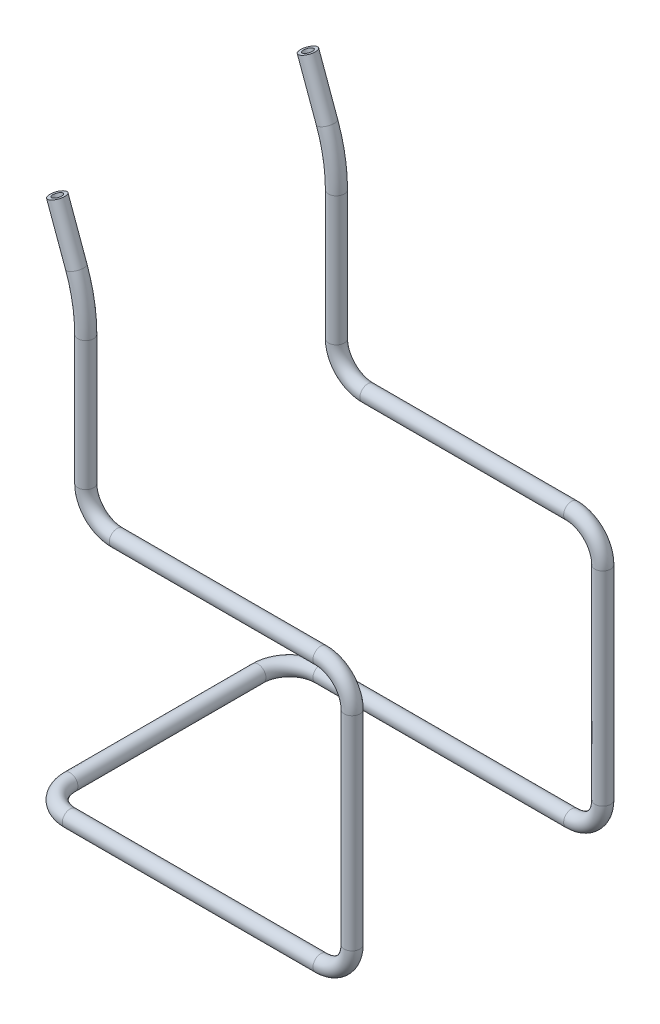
ISO-10303-21;
HEADER;
FILE_DESCRIPTION(('STEP AP214'),'2;1');
FILE_NAME('part.step','',(''),(''),'','','');
FILE_SCHEMA(('AUTOMOTIVE_DESIGN { 1 0 10303 214 1 1 1 1 }'));
ENDSEC;
DATA;
#1=APPLICATION_CONTEXT('core data for automotive mechanical design processes');
#2=APPLICATION_PROTOCOL_DEFINITION('international standard','automotive_design',2000,#1);
#3=PRODUCT_CONTEXT('',#1,'mechanical');
#4=PRODUCT('Part','Part','',(#3));
#5=PRODUCT_RELATED_PRODUCT_CATEGORY('part','',(#4));
#6=PRODUCT_DEFINITION_FORMATION('','',#4);
#7=PRODUCT_DEFINITION_CONTEXT('part definition',#1,'design');
#8=PRODUCT_DEFINITION('design','',#6,#7);
#9=PRODUCT_DEFINITION_SHAPE('','',#8);
#10=(LENGTH_UNIT() NAMED_UNIT(*) SI_UNIT(.MILLI.,.METRE.));
#11=(NAMED_UNIT(*) PLANE_ANGLE_UNIT() SI_UNIT($,.RADIAN.));
#12=(NAMED_UNIT(*) SI_UNIT($,.STERADIAN.) SOLID_ANGLE_UNIT());
#13=UNCERTAINTY_MEASURE_WITH_UNIT(LENGTH_MEASURE(1.E-05),#10,'distance_accuracy_value','');
#14=(GEOMETRIC_REPRESENTATION_CONTEXT(3) GLOBAL_UNCERTAINTY_ASSIGNED_CONTEXT((#13)) GLOBAL_UNIT_ASSIGNED_CONTEXT((#10,
#11,#12)) REPRESENTATION_CONTEXT('',''));
#15=CARTESIAN_POINT('',(0.,0.,0.));
#16=DIRECTION('',(0.,0.,1.));
#17=DIRECTION('',(1.,0.,0.));
#18=AXIS2_PLACEMENT_3D('',#15,#16,#17);
#19=CARTESIAN_POINT('',(11.9846310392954,153.28465813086,40.));
#20=DIRECTION('',(-0.34202014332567,0.939692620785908,0.));
#21=DIRECTION('',(-0.939692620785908,-0.34202014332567,0.));
#22=AXIS2_PLACEMENT_3D('',#19,#20,#21);
#23=CYLINDRICAL_SURFACE('',#22,2.5);
#24=CARTESIAN_POINT('',(11.9846310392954,153.28465813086,40.));
#25=DIRECTION('',(-0.34202014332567,0.939692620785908,0.));
#26=DIRECTION('',(0.,0.,-1.));
#27=AXIS2_PLACEMENT_3D('',#24,#25,#26);
#28=CIRCLE('',#27,2.5);
#29=CARTESIAN_POINT('',(14.3338625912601,154.139708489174,39.9999999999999));
#30=VERTEX_POINT('',#29);
#31=EDGE_CURVE('E30',#30,#30,#28,.T.);
#32=ORIENTED_EDGE('',*,*,#31,.T.);
#33=EDGE_LOOP('',(#32));
#34=FACE_BOUND('',#33,.T.);
#35=CARTESIAN_POINT('',(5.90074414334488,170.,40.0000000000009));
#36=DIRECTION('',(-0.34202014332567,0.939692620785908,0.));
#37=DIRECTION('',(0.,0.,-1.));
#38=AXIS2_PLACEMENT_3D('',#35,#36,#37);
#39=CIRCLE('',#38,2.5);
#40=CARTESIAN_POINT('',(5.90074414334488,170.,37.5000000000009));
#41=VERTEX_POINT('',#40);
#42=EDGE_CURVE('E10',#41,#41,#39,.T.);
#43=ORIENTED_EDGE('',*,*,#42,.F.);
#44=EDGE_LOOP('',(#43));
#45=FACE_BOUND('',#44,.T.);
#46=ADVANCED_FACE('F24',(#34,#45),#23,.T.);
#47=CARTESIAN_POINT('',(-35.,136.183650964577,40.0000000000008));
#48=DIRECTION('',(0.,0.,1.));
#49=DIRECTION('',(1.,0.,0.));
#50=AXIS2_PLACEMENT_3D('',#47,#48,#49);
#51=TOROIDAL_SURFACE('',#50,50.,2.5);
#52=CARTESIAN_POINT('',(15.,136.183650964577,39.9999999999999));
#53=DIRECTION('',(0.,1.,0.));
#54=DIRECTION('',(0.,0.,-1.));
#55=AXIS2_PLACEMENT_3D('',#52,#53,#54);
#56=CIRCLE('',#55,2.5);
#57=CARTESIAN_POINT('',(17.5,136.183650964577,39.9999999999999));
#58=VERTEX_POINT('',#57);
#59=EDGE_CURVE('E34',#58,#58,#56,.T.);
#60=CARTESIAN_POINT('',(-35.,136.183650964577,40.0000000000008));
#61=DIRECTION('',(0.,0.,1.));
#62=DIRECTION('',(1.,0.,0.));
#63=AXIS2_PLACEMENT_3D('',#60,#61,#62);
#64=CIRCLE('',#63,52.5);
#65=EDGE_CURVE('',#58,#30,#64,.T.);
#66=ORIENTED_EDGE('',*,*,#59,.T.);
#67=ORIENTED_EDGE('',*,*,#31,.F.);
#68=ORIENTED_EDGE('',*,*,#65,.T.);
#69=ORIENTED_EDGE('',*,*,#65,.F.);
#70=EDGE_LOOP('',(#66,#68,#67,#69));
#71=FACE_BOUND('',#70,.T.);
#72=ADVANCED_FACE('F182',(#71),#51,.T.);
#73=CARTESIAN_POINT('',(15.,95.,40.));
#74=DIRECTION('',(0.,1.,0.));
#75=DIRECTION('',(0.,0.,1.));
#76=AXIS2_PLACEMENT_3D('',#73,#74,#75);
#77=CYLINDRICAL_SURFACE('',#76,2.5);
#78=CARTESIAN_POINT('',(15.,95.,40.));
#79=DIRECTION('',(0.,1.,0.));
#80=DIRECTION('',(0.,0.,-1.));
#81=AXIS2_PLACEMENT_3D('',#78,#79,#80);
#82=CIRCLE('',#81,2.5);
#83=CARTESIAN_POINT('',(12.5,95.,40.));
#84=VERTEX_POINT('',#83);
#85=EDGE_CURVE('E38',#84,#84,#82,.T.);
#86=ORIENTED_EDGE('',*,*,#85,.T.);
#87=EDGE_LOOP('',(#86));
#88=FACE_BOUND('',#87,.T.);
#89=ORIENTED_EDGE('',*,*,#59,.F.);
#90=EDGE_LOOP('',(#89));
#91=FACE_BOUND('',#90,.T.);
#92=ADVANCED_FACE('F186',(#88,#91),#77,.T.);
#93=CARTESIAN_POINT('',(25.,95.,40.));
#94=DIRECTION('',(0.,0.,-1.));
#95=DIRECTION('',(-1.,0.,0.));
#96=AXIS2_PLACEMENT_3D('',#93,#94,#95);
#97=TOROIDAL_SURFACE('',#96,10.,2.5);
#98=CARTESIAN_POINT('',(25.,85.,40.));
#99=DIRECTION('',(-1.,0.,0.));
#100=DIRECTION('',(0.,0.,-1.));
#101=AXIS2_PLACEMENT_3D('',#98,#99,#100);
#102=CIRCLE('',#101,2.5);
#103=CARTESIAN_POINT('',(25.,82.5,40.));
#104=VERTEX_POINT('',#103);
#105=EDGE_CURVE('E43',#104,#104,#102,.T.);
#106=CARTESIAN_POINT('',(25.,95.,40.));
#107=DIRECTION('',(0.,0.,-1.));
#108=DIRECTION('',(-1.,0.,0.));
#109=AXIS2_PLACEMENT_3D('',#106,#107,#108);
#110=CIRCLE('',#109,12.5);
#111=EDGE_CURVE('',#104,#84,#110,.T.);
#112=ORIENTED_EDGE('',*,*,#105,.T.);
#113=ORIENTED_EDGE('',*,*,#85,.F.);
#114=ORIENTED_EDGE('',*,*,#111,.T.);
#115=ORIENTED_EDGE('',*,*,#111,.F.);
#116=EDGE_LOOP('',(#112,#114,#113,#115));
#117=FACE_BOUND('',#116,.T.);
#118=ADVANCED_FACE('F192',(#117),#97,.T.);
#119=CARTESIAN_POINT('',(90.,85.,40.));
#120=DIRECTION('',(-1.,0.,0.));
#121=DIRECTION('',(0.,0.,1.));
#122=AXIS2_PLACEMENT_3D('',#119,#120,#121);
#123=CYLINDRICAL_SURFACE('',#122,2.5);
#124=CARTESIAN_POINT('',(90.,85.,40.));
#125=DIRECTION('',(-1.,0.,0.));
#126=DIRECTION('',(0.,0.,-1.));
#127=AXIS2_PLACEMENT_3D('',#124,#125,#126);
#128=CIRCLE('',#127,2.5);
#129=CARTESIAN_POINT('',(90.,87.5,40.));
#130=VERTEX_POINT('',#129);
#131=EDGE_CURVE('E46',#130,#130,#128,.T.);
#132=ORIENTED_EDGE('',*,*,#131,.T.);
#133=EDGE_LOOP('',(#132));
#134=FACE_BOUND('',#133,.T.);
#135=ORIENTED_EDGE('',*,*,#105,.F.);
#136=EDGE_LOOP('',(#135));
#137=FACE_BOUND('',#136,.T.);
#138=ADVANCED_FACE('F199',(#134,#137),#123,.T.);
#139=CARTESIAN_POINT('',(90.,75.,40.));
#140=DIRECTION('',(0.,0.,1.));
#141=DIRECTION('',(1.,0.,0.));
#142=AXIS2_PLACEMENT_3D('',#139,#140,#141);
#143=TOROIDAL_SURFACE('',#142,9.99999999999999,2.5);
#144=CARTESIAN_POINT('',(100.,75.,40.));
#145=DIRECTION('',(0.,1.,0.));
#146=DIRECTION('',(0.,0.,-1.));
#147=AXIS2_PLACEMENT_3D('',#144,#145,#146);
#148=CIRCLE('',#147,2.5);
#149=CARTESIAN_POINT('',(102.5,75.,40.));
#150=VERTEX_POINT('',#149);
#151=EDGE_CURVE('E49',#150,#150,#148,.T.);
#152=CARTESIAN_POINT('',(90.,75.,40.));
#153=DIRECTION('',(0.,0.,1.));
#154=DIRECTION('',(1.,0.,0.));
#155=AXIS2_PLACEMENT_3D('',#152,#153,#154);
#156=CIRCLE('',#155,12.5);
#157=EDGE_CURVE('',#150,#130,#156,.T.);
#158=ORIENTED_EDGE('',*,*,#151,.T.);
#159=ORIENTED_EDGE('',*,*,#131,.F.);
#160=ORIENTED_EDGE('',*,*,#157,.T.);
#161=ORIENTED_EDGE('',*,*,#157,.F.);
#162=EDGE_LOOP('',(#158,#160,#159,#161));
#163=FACE_BOUND('',#162,.T.);
#164=ADVANCED_FACE('F203',(#163),#143,.T.);
#165=CARTESIAN_POINT('',(100.,9.99999999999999,40.));
#166=DIRECTION('',(0.,1.,0.));
#167=DIRECTION('',(0.,0.,1.));
#168=AXIS2_PLACEMENT_3D('',#165,#166,#167);
#169=CYLINDRICAL_SURFACE('',#168,2.5);
#170=CARTESIAN_POINT('',(100.,9.99999999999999,40.));
#171=DIRECTION('',(0.,1.,0.));
#172=DIRECTION('',(0.,0.,-1.));
#173=AXIS2_PLACEMENT_3D('',#170,#171,#172);
#174=CIRCLE('',#173,2.5);
#175=CARTESIAN_POINT('',(102.5,9.99999999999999,40.));
#176=VERTEX_POINT('',#175);
#177=EDGE_CURVE('E52',#176,#176,#174,.T.);
#178=ORIENTED_EDGE('',*,*,#177,.T.);
#179=EDGE_LOOP('',(#178));
#180=FACE_BOUND('',#179,.T.);
#181=ORIENTED_EDGE('',*,*,#151,.F.);
#182=EDGE_LOOP('',(#181));
#183=FACE_BOUND('',#182,.T.);
#184=ADVANCED_FACE('F207',(#180,#183),#169,.T.);
#185=CARTESIAN_POINT('',(90.,10.,40.));
#186=DIRECTION('',(0.,0.,1.));
#187=DIRECTION('',(1.,0.,0.));
#188=AXIS2_PLACEMENT_3D('',#185,#186,#187);
#189=TOROIDAL_SURFACE('',#188,10.,2.5);
#190=CARTESIAN_POINT('',(90.,0.,40.));
#191=DIRECTION('',(1.,0.,0.));
#192=DIRECTION('',(0.,0.,-1.));
#193=AXIS2_PLACEMENT_3D('',#190,#191,#192);
#194=CIRCLE('',#193,2.5);
#195=CARTESIAN_POINT('',(90.,-2.5,40.));
#196=VERTEX_POINT('',#195);
#197=EDGE_CURVE('E55',#196,#196,#194,.T.);
#198=CARTESIAN_POINT('',(90.,10.,40.));
#199=DIRECTION('',(0.,0.,1.));
#200=DIRECTION('',(1.,0.,0.));
#201=AXIS2_PLACEMENT_3D('',#198,#199,#200);
#202=CIRCLE('',#201,12.5);
#203=EDGE_CURVE('',#196,#176,#202,.T.);
#204=ORIENTED_EDGE('',*,*,#197,.T.);
#205=ORIENTED_EDGE('',*,*,#177,.F.);
#206=ORIENTED_EDGE('',*,*,#203,.T.);
#207=ORIENTED_EDGE('',*,*,#203,.F.);
#208=EDGE_LOOP('',(#204,#206,#205,#207));
#209=FACE_BOUND('',#208,.T.);
#210=ADVANCED_FACE('F211',(#209),#189,.T.);
#211=CARTESIAN_POINT('',(10.,0.,40.));
#212=DIRECTION('',(1.,0.,0.));
#213=DIRECTION('',(0.,0.,-1.));
#214=AXIS2_PLACEMENT_3D('',#211,#212,#213);
#215=CYLINDRICAL_SURFACE('',#214,2.5);
#216=CARTESIAN_POINT('',(10.,0.,40.));
#217=DIRECTION('',(1.,0.,0.));
#218=DIRECTION('',(0.,0.,-1.));
#219=AXIS2_PLACEMENT_3D('',#216,#217,#218);
#220=CIRCLE('',#219,2.5);
#221=CARTESIAN_POINT('',(10.,0.,42.5));
#222=VERTEX_POINT('',#221);
#223=EDGE_CURVE('E58',#222,#222,#220,.T.);
#224=ORIENTED_EDGE('',*,*,#223,.T.);
#225=EDGE_LOOP('',(#224));
#226=FACE_BOUND('',#225,.T.);
#227=ORIENTED_EDGE('',*,*,#197,.F.);
#228=EDGE_LOOP('',(#227));
#229=FACE_BOUND('',#228,.T.);
#230=ADVANCED_FACE('F215',(#226,#229),#215,.T.);
#231=CARTESIAN_POINT('',(10.,0.,30.));
#232=DIRECTION('',(0.,1.,0.));
#233=DIRECTION('',(0.,0.,1.));
#234=AXIS2_PLACEMENT_3D('',#231,#232,#233);
#235=TOROIDAL_SURFACE('',#234,10.,2.5);
#236=CARTESIAN_POINT('',(0.,0.,30.));
#237=DIRECTION('',(0.,0.,1.));
#238=DIRECTION('',(1.,0.,0.));
#239=AXIS2_PLACEMENT_3D('',#236,#237,#238);
#240=CIRCLE('',#239,2.5);
#241=CARTESIAN_POINT('',(-2.5,0.,30.));
#242=VERTEX_POINT('',#241);
#243=EDGE_CURVE('E61',#242,#242,#240,.T.);
#244=CARTESIAN_POINT('',(10.,0.,30.));
#245=DIRECTION('',(0.,1.,0.));
#246=DIRECTION('',(0.,0.,1.));
#247=AXIS2_PLACEMENT_3D('',#244,#245,#246);
#248=CIRCLE('',#247,12.5);
#249=EDGE_CURVE('',#242,#222,#248,.T.);
#250=ORIENTED_EDGE('',*,*,#243,.T.);
#251=ORIENTED_EDGE('',*,*,#223,.F.);
#252=ORIENTED_EDGE('',*,*,#249,.T.);
#253=ORIENTED_EDGE('',*,*,#249,.F.);
#254=EDGE_LOOP('',(#250,#252,#251,#253));
#255=FACE_BOUND('',#254,.T.);
#256=ADVANCED_FACE('F219',(#255),#235,.T.);
#257=CARTESIAN_POINT('',(0.,0.,30.));
#258=DIRECTION('',(0.,0.,-1.));
#259=DIRECTION('',(-1.,0.,0.));
#260=AXIS2_PLACEMENT_3D('',#257,#258,#259);
#261=CYLINDRICAL_SURFACE('',#260,2.5);
#262=CARTESIAN_POINT('',(0.,0.,-30.));
#263=DIRECTION('',(0.,0.,1.));
#264=DIRECTION('',(1.,0.,0.));
#265=AXIS2_PLACEMENT_3D('',#262,#263,#264);
#266=CIRCLE('',#265,2.5);
#267=CARTESIAN_POINT('',(-2.5,0.,-30.));
#268=VERTEX_POINT('',#267);
#269=EDGE_CURVE('E127',#268,#268,#266,.T.);
#270=CARTESIAN_POINT('',(-2.5,0.,30.));
#271=CARTESIAN_POINT('',(-2.5,0.,29.375));
#272=CARTESIAN_POINT('',(-2.5,0.,28.75));
#273=CARTESIAN_POINT('',(-2.5,0.,27.5));
#274=CARTESIAN_POINT('',(-2.5,0.,26.875));
#275=CARTESIAN_POINT('',(-2.5,0.,25.625));
#276=CARTESIAN_POINT('',(-2.5,0.,25.));
#277=CARTESIAN_POINT('',(-2.5,0.,23.75));
#278=CARTESIAN_POINT('',(-2.5,0.,23.125));
#279=CARTESIAN_POINT('',(-2.5,0.,21.875));
#280=CARTESIAN_POINT('',(-2.5,0.,21.25));
#281=CARTESIAN_POINT('',(-2.5,0.,20.));
#282=CARTESIAN_POINT('',(-2.5,0.,19.375));
#283=CARTESIAN_POINT('',(-2.5,0.,18.125));
#284=CARTESIAN_POINT('',(-2.5,0.,17.5));
#285=CARTESIAN_POINT('',(-2.5,0.,16.25));
#286=CARTESIAN_POINT('',(-2.5,0.,15.625));
#287=CARTESIAN_POINT('',(-2.5,0.,14.375));
#288=CARTESIAN_POINT('',(-2.5,0.,13.75));
#289=CARTESIAN_POINT('',(-2.5,0.,12.5));
#290=CARTESIAN_POINT('',(-2.5,0.,11.875));
#291=CARTESIAN_POINT('',(-2.5,0.,10.625));
#292=CARTESIAN_POINT('',(-2.5,0.,10.));
#293=CARTESIAN_POINT('',(-2.5,0.,8.75));
#294=CARTESIAN_POINT('',(-2.5,0.,8.125));
#295=CARTESIAN_POINT('',(-2.5,0.,6.875));
#296=CARTESIAN_POINT('',(-2.5,0.,6.25));
#297=CARTESIAN_POINT('',(-2.5,0.,5.));
#298=CARTESIAN_POINT('',(-2.5,0.,4.375));
#299=CARTESIAN_POINT('',(-2.5,0.,3.125));
#300=CARTESIAN_POINT('',(-2.5,0.,2.5));
#301=CARTESIAN_POINT('',(-2.5,0.,1.25));
#302=CARTESIAN_POINT('',(-2.5,0.,0.625));
#303=CARTESIAN_POINT('',(-2.5,0.,-0.624999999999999));
#304=CARTESIAN_POINT('',(-2.5,0.,-1.25));
#305=CARTESIAN_POINT('',(-2.5,0.,-2.5));
#306=CARTESIAN_POINT('',(-2.5,0.,-3.125));
#307=CARTESIAN_POINT('',(-2.5,0.,-4.375));
#308=CARTESIAN_POINT('',(-2.5,0.,-5.));
#309=CARTESIAN_POINT('',(-2.5,0.,-6.25));
#310=CARTESIAN_POINT('',(-2.5,0.,-6.875));
#311=CARTESIAN_POINT('',(-2.5,0.,-8.125));
#312=CARTESIAN_POINT('',(-2.5,0.,-8.75));
#313=CARTESIAN_POINT('',(-2.5,0.,-10.));
#314=CARTESIAN_POINT('',(-2.5,0.,-10.625));
#315=CARTESIAN_POINT('',(-2.5,0.,-11.875));
#316=CARTESIAN_POINT('',(-2.5,0.,-12.5));
#317=CARTESIAN_POINT('',(-2.5,0.,-13.75));
#318=CARTESIAN_POINT('',(-2.5,0.,-14.375));
#319=CARTESIAN_POINT('',(-2.5,0.,-15.625));
#320=CARTESIAN_POINT('',(-2.5,0.,-16.25));
#321=CARTESIAN_POINT('',(-2.5,0.,-17.5));
#322=CARTESIAN_POINT('',(-2.5,0.,-18.125));
#323=CARTESIAN_POINT('',(-2.5,0.,-19.375));
#324=CARTESIAN_POINT('',(-2.5,0.,-20.));
#325=CARTESIAN_POINT('',(-2.5,0.,-21.25));
#326=CARTESIAN_POINT('',(-2.5,0.,-21.875));
#327=CARTESIAN_POINT('',(-2.5,0.,-23.125));
#328=CARTESIAN_POINT('',(-2.5,0.,-23.75));
#329=CARTESIAN_POINT('',(-2.5,0.,-25.));
#330=CARTESIAN_POINT('',(-2.5,0.,-25.625));
#331=CARTESIAN_POINT('',(-2.5,0.,-26.875));
#332=CARTESIAN_POINT('',(-2.5,0.,-27.5));
#333=CARTESIAN_POINT('',(-2.5,0.,-28.75));
#334=CARTESIAN_POINT('',(-2.5,0.,-29.375));
#335=CARTESIAN_POINT('',(-2.5,0.,-30.));
#336=B_SPLINE_CURVE_WITH_KNOTS('',3,(#270,#271,#272,#273,#274,#275,#276,#277,#278,#279,#280,
#281,#282,#283,#284,#285,#286,#287,#288,#289,#290,#291,#292,#293,#294,#295,#296,#297,#298,#299,
#300,#301,#302,#303,#304,#305,#306,#307,#308,#309,#310,#311,#312,#313,#314,#315,#316,#317,#318,
#319,#320,#321,#322,#323,#324,#325,#326,#327,#328,#329,#330,#331,#332,#333,#334,#335),
.UNSPECIFIED.,.F.,.F.,(4,2,2,2,2,2,2,2,2,2,2,2,2,2,2,2,2,2,2,2,2,2,2,2,2,2,2,2,2,2,2,2,4),(0.,
1.875,3.75,5.625,7.5,9.375,11.25,13.125,15.,16.875,18.75,20.625,22.5,24.375,26.25,28.125,30.,
31.875,33.75,35.625,37.5,39.375,41.25,43.125,45.,46.875,48.75,50.625,52.5,54.375,56.25,58.125,
60.),.UNSPECIFIED.);
#337=EDGE_CURVE('BSEAM223',#242,#268,#336,.T.);
#338=ORIENTED_EDGE('',*,*,#243,.F.);
#339=ORIENTED_EDGE('',*,*,#269,.T.);
#340=ORIENTED_EDGE('',*,*,#337,.T.);
#341=ORIENTED_EDGE('',*,*,#337,.F.);
#342=EDGE_LOOP('',(#338,#340,#339,#341));
#343=FACE_BOUND('',#342,.T.);
#344=ADVANCED_FACE('F223',(#343),#261,.T.);
#345=CARTESIAN_POINT('',(5.90074414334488,170.,40.0000000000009));
#346=DIRECTION('',(-0.34202014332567,0.939692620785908,0.));
#347=DIRECTION('',(0.,0.,-1.));
#348=AXIS2_PLACEMENT_3D('',#345,#346,#347);
#349=PLANE('',#348);
#350=CARTESIAN_POINT('',(5.90074414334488,170.,40.0000000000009));
#351=DIRECTION('',(-0.34202014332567,0.939692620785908,0.));
#352=DIRECTION('',(-0.939692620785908,-0.342020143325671,0.));
#353=AXIS2_PLACEMENT_3D('',#350,#351,#352);
#354=CIRCLE('',#353,1.5);
#355=CARTESIAN_POINT('',(4.49120521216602,169.486969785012,40.0000000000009));
#356=VERTEX_POINT('',#355);
#357=EDGE_CURVE('E64',#356,#356,#354,.T.);
#358=ORIENTED_EDGE('',*,*,#357,.F.);
#359=EDGE_LOOP('',(#358));
#360=FACE_BOUND('',#359,.T.);
#361=ORIENTED_EDGE('',*,*,#42,.T.);
#362=EDGE_LOOP('',(#361));
#363=FACE_BOUND('',#362,.T.);
#364=ADVANCED_FACE('F227',(#360,#363),#349,.T.);
#365=CARTESIAN_POINT('',(11.9846310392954,153.28465813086,40.));
#366=DIRECTION('',(-0.34202014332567,0.939692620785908,0.));
#367=DIRECTION('',(-0.939692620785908,-0.34202014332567,0.));
#368=AXIS2_PLACEMENT_3D('',#365,#366,#367);
#369=CYLINDRICAL_SURFACE('',#368,1.5);
#370=CARTESIAN_POINT('',(11.9846310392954,153.28465813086,40.));
#371=DIRECTION('',(-0.34202014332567,0.939692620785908,0.));
#372=DIRECTION('',(-0.939692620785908,-0.34202014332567,0.));
#373=AXIS2_PLACEMENT_3D('',#370,#371,#372);
#374=CIRCLE('',#373,1.5);
#375=CARTESIAN_POINT('',(13.3941699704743,153.797688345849,39.9999999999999));
#376=VERTEX_POINT('',#375);
#377=EDGE_CURVE('E67',#376,#376,#374,.T.);
#378=ORIENTED_EDGE('',*,*,#377,.F.);
#379=EDGE_LOOP('',(#378));
#380=FACE_BOUND('',#379,.T.);
#381=ORIENTED_EDGE('',*,*,#357,.T.);
#382=EDGE_LOOP('',(#381));
#383=FACE_BOUND('',#382,.T.);
#384=ADVANCED_FACE('F231',(#380,#383),#369,.F.);
#385=CARTESIAN_POINT('',(-35.,136.183650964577,40.0000000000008));
#386=DIRECTION('',(0.,0.,1.));
#387=DIRECTION('',(1.,0.,0.));
#388=AXIS2_PLACEMENT_3D('',#385,#386,#387);
#389=TOROIDAL_SURFACE('',#388,50.,1.5);
#390=CARTESIAN_POINT('',(15.,136.183650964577,39.9999999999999));
#391=DIRECTION('',(0.,-1.,0.));
#392=DIRECTION('',(0.,0.,-1.));
#393=AXIS2_PLACEMENT_3D('',#390,#391,#392);
#394=CIRCLE('',#393,1.5);
#395=CARTESIAN_POINT('',(16.5,136.183650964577,39.9999999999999));
#396=VERTEX_POINT('',#395);
#397=EDGE_CURVE('E93',#396,#396,#394,.F.);
#398=CARTESIAN_POINT('',(-35.,136.183650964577,40.0000000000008));
#399=DIRECTION('',(0.,0.,1.));
#400=DIRECTION('',(1.,0.,0.));
#401=AXIS2_PLACEMENT_3D('',#398,#399,#400);
#402=CIRCLE('',#401,51.5);
#403=EDGE_CURVE('',#396,#376,#402,.T.);
#404=ORIENTED_EDGE('',*,*,#397,.F.);
#405=ORIENTED_EDGE('',*,*,#377,.T.);
#406=ORIENTED_EDGE('',*,*,#403,.T.);
#407=ORIENTED_EDGE('',*,*,#403,.F.);
#408=EDGE_LOOP('',(#404,#406,#405,#407));
#409=FACE_BOUND('',#408,.T.);
#410=ADVANCED_FACE('F269',(#409),#389,.F.);
#411=CARTESIAN_POINT('',(15.,95.,40.));
#412=DIRECTION('',(0.,1.,0.));
#413=DIRECTION('',(0.,0.,1.));
#414=AXIS2_PLACEMENT_3D('',#411,#412,#413);
#415=CYLINDRICAL_SURFACE('',#414,1.5);
#416=CARTESIAN_POINT('',(15.,95.,40.));
#417=DIRECTION('',(0.,1.,0.));
#418=DIRECTION('',(0.,0.,1.));
#419=AXIS2_PLACEMENT_3D('',#416,#417,#418);
#420=CIRCLE('',#419,1.5);
#421=CARTESIAN_POINT('',(13.5,95.,40.));
#422=VERTEX_POINT('',#421);
#423=EDGE_CURVE('E90',#422,#422,#420,.T.);
#424=ORIENTED_EDGE('',*,*,#423,.F.);
#425=EDGE_LOOP('',(#424));
#426=FACE_BOUND('',#425,.T.);
#427=ORIENTED_EDGE('',*,*,#397,.T.);
#428=EDGE_LOOP('',(#427));
#429=FACE_BOUND('',#428,.T.);
#430=ADVANCED_FACE('F265',(#426,#429),#415,.F.);
#431=CARTESIAN_POINT('',(25.,95.,40.));
#432=DIRECTION('',(0.,0.,-1.));
#433=DIRECTION('',(-1.,0.,0.));
#434=AXIS2_PLACEMENT_3D('',#431,#432,#433);
#435=TOROIDAL_SURFACE('',#434,10.,1.5);
#436=CARTESIAN_POINT('',(25.,85.,40.));
#437=DIRECTION('',(1.,0.,0.));
#438=DIRECTION('',(0.,1.,0.));
#439=AXIS2_PLACEMENT_3D('',#436,#437,#438);
#440=CIRCLE('',#439,1.5);
#441=CARTESIAN_POINT('',(25.,83.5,40.));
#442=VERTEX_POINT('',#441);
#443=EDGE_CURVE('E87',#442,#442,#440,.F.);
#444=CARTESIAN_POINT('',(25.,95.,40.));
#445=DIRECTION('',(0.,0.,-1.));
#446=DIRECTION('',(-1.,0.,0.));
#447=AXIS2_PLACEMENT_3D('',#444,#445,#446);
#448=CIRCLE('',#447,11.5);
#449=EDGE_CURVE('',#442,#422,#448,.T.);
#450=ORIENTED_EDGE('',*,*,#443,.F.);
#451=ORIENTED_EDGE('',*,*,#423,.T.);
#452=ORIENTED_EDGE('',*,*,#449,.T.);
#453=ORIENTED_EDGE('',*,*,#449,.F.);
#454=EDGE_LOOP('',(#450,#452,#451,#453));
#455=FACE_BOUND('',#454,.T.);
#456=ADVANCED_FACE('F261',(#455),#435,.F.);
#457=CARTESIAN_POINT('',(90.,85.,40.));
#458=DIRECTION('',(-1.,0.,0.));
#459=DIRECTION('',(0.,0.,1.));
#460=AXIS2_PLACEMENT_3D('',#457,#458,#459);
#461=CYLINDRICAL_SURFACE('',#460,1.5);
#462=CARTESIAN_POINT('',(90.,85.,40.));
#463=DIRECTION('',(-1.,0.,0.));
#464=DIRECTION('',(0.,0.,1.));
#465=AXIS2_PLACEMENT_3D('',#462,#463,#464);
#466=CIRCLE('',#465,1.5);
#467=CARTESIAN_POINT('',(90.,86.5,40.));
#468=VERTEX_POINT('',#467);
#469=EDGE_CURVE('E84',#468,#468,#466,.T.);
#470=ORIENTED_EDGE('',*,*,#469,.F.);
#471=EDGE_LOOP('',(#470));
#472=FACE_BOUND('',#471,.T.);
#473=ORIENTED_EDGE('',*,*,#443,.T.);
#474=EDGE_LOOP('',(#473));
#475=FACE_BOUND('',#474,.T.);
#476=ADVANCED_FACE('F257',(#472,#475),#461,.F.);
#477=CARTESIAN_POINT('',(90.,75.,40.));
#478=DIRECTION('',(0.,0.,1.));
#479=DIRECTION('',(1.,0.,0.));
#480=AXIS2_PLACEMENT_3D('',#477,#478,#479);
#481=TOROIDAL_SURFACE('',#480,9.99999999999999,1.5);
#482=CARTESIAN_POINT('',(100.,75.,40.));
#483=DIRECTION('',(0.,-1.,0.));
#484=DIRECTION('',(1.,0.,0.));
#485=AXIS2_PLACEMENT_3D('',#482,#483,#484);
#486=CIRCLE('',#485,1.5);
#487=CARTESIAN_POINT('',(101.5,75.,40.));
#488=VERTEX_POINT('',#487);
#489=EDGE_CURVE('E81',#488,#488,#486,.F.);
#490=CARTESIAN_POINT('',(90.,75.,40.));
#491=DIRECTION('',(0.,0.,1.));
#492=DIRECTION('',(1.,0.,0.));
#493=AXIS2_PLACEMENT_3D('',#490,#491,#492);
#494=CIRCLE('',#493,11.5);
#495=EDGE_CURVE('',#488,#468,#494,.T.);
#496=ORIENTED_EDGE('',*,*,#489,.F.);
#497=ORIENTED_EDGE('',*,*,#469,.T.);
#498=ORIENTED_EDGE('',*,*,#495,.T.);
#499=ORIENTED_EDGE('',*,*,#495,.F.);
#500=EDGE_LOOP('',(#496,#498,#497,#499));
#501=FACE_BOUND('',#500,.T.);
#502=ADVANCED_FACE('F253',(#501),#481,.F.);
#503=CARTESIAN_POINT('',(100.,9.99999999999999,40.));
#504=DIRECTION('',(0.,1.,0.));
#505=DIRECTION('',(0.,0.,1.));
#506=AXIS2_PLACEMENT_3D('',#503,#504,#505);
#507=CYLINDRICAL_SURFACE('',#506,1.5);
#508=CARTESIAN_POINT('',(100.,9.99999999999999,40.));
#509=DIRECTION('',(0.,1.,0.));
#510=DIRECTION('',(0.,0.,1.));
#511=AXIS2_PLACEMENT_3D('',#508,#509,#510);
#512=CIRCLE('',#511,1.5);
#513=CARTESIAN_POINT('',(101.5,9.99999999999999,40.));
#514=VERTEX_POINT('',#513);
#515=EDGE_CURVE('E78',#514,#514,#512,.T.);
#516=ORIENTED_EDGE('',*,*,#515,.F.);
#517=EDGE_LOOP('',(#516));
#518=FACE_BOUND('',#517,.T.);
#519=ORIENTED_EDGE('',*,*,#489,.T.);
#520=EDGE_LOOP('',(#519));
#521=FACE_BOUND('',#520,.T.);
#522=ADVANCED_FACE('F249',(#518,#521),#507,.F.);
#523=CARTESIAN_POINT('',(90.,10.,40.));
#524=DIRECTION('',(0.,0.,1.));
#525=DIRECTION('',(1.,0.,0.));
#526=AXIS2_PLACEMENT_3D('',#523,#524,#525);
#527=TOROIDAL_SURFACE('',#526,10.,1.5);
#528=CARTESIAN_POINT('',(90.,0.,40.));
#529=DIRECTION('',(-1.,0.,0.));
#530=DIRECTION('',(0.,-1.,0.));
#531=AXIS2_PLACEMENT_3D('',#528,#529,#530);
#532=CIRCLE('',#531,1.5);
#533=CARTESIAN_POINT('',(90.,-1.5,40.));
#534=VERTEX_POINT('',#533);
#535=EDGE_CURVE('E75',#534,#534,#532,.F.);
#536=CARTESIAN_POINT('',(90.,10.,40.));
#537=DIRECTION('',(0.,0.,1.));
#538=DIRECTION('',(1.,0.,0.));
#539=AXIS2_PLACEMENT_3D('',#536,#537,#538);
#540=CIRCLE('',#539,11.5);
#541=EDGE_CURVE('',#534,#514,#540,.T.);
#542=ORIENTED_EDGE('',*,*,#535,.F.);
#543=ORIENTED_EDGE('',*,*,#515,.T.);
#544=ORIENTED_EDGE('',*,*,#541,.T.);
#545=ORIENTED_EDGE('',*,*,#541,.F.);
#546=EDGE_LOOP('',(#542,#544,#543,#545));
#547=FACE_BOUND('',#546,.T.);
#548=ADVANCED_FACE('F245',(#547),#527,.F.);
#549=CARTESIAN_POINT('',(10.,0.,40.));
#550=DIRECTION('',(1.,0.,0.));
#551=DIRECTION('',(0.,0.,-1.));
#552=AXIS2_PLACEMENT_3D('',#549,#550,#551);
#553=CYLINDRICAL_SURFACE('',#552,1.5);
#554=CARTESIAN_POINT('',(10.,0.,40.));
#555=DIRECTION('',(1.,0.,0.));
#556=DIRECTION('',(0.,0.,-1.));
#557=AXIS2_PLACEMENT_3D('',#554,#555,#556);
#558=CIRCLE('',#557,1.5);
#559=CARTESIAN_POINT('',(10.,0.,41.5));
#560=VERTEX_POINT('',#559);
#561=EDGE_CURVE('E71',#560,#560,#558,.T.);
#562=ORIENTED_EDGE('',*,*,#561,.F.);
#563=EDGE_LOOP('',(#562));
#564=FACE_BOUND('',#563,.T.);
#565=ORIENTED_EDGE('',*,*,#535,.T.);
#566=EDGE_LOOP('',(#565));
#567=FACE_BOUND('',#566,.T.);
#568=ADVANCED_FACE('F241',(#564,#567),#553,.F.);
#569=CARTESIAN_POINT('',(10.,0.,30.));
#570=DIRECTION('',(0.,1.,0.));
#571=DIRECTION('',(0.,0.,1.));
#572=AXIS2_PLACEMENT_3D('',#569,#570,#571);
#573=TOROIDAL_SURFACE('',#572,10.,1.5);
#574=CARTESIAN_POINT('',(0.,0.,30.));
#575=DIRECTION('',(0.,0.,-1.));
#576=DIRECTION('',(-1.,0.,0.));
#577=AXIS2_PLACEMENT_3D('',#574,#575,#576);
#578=CIRCLE('',#577,1.5);
#579=CARTESIAN_POINT('',(-1.5,0.,30.));
#580=VERTEX_POINT('',#579);
#581=EDGE_CURVE('E68',#580,#580,#578,.F.);
#582=CARTESIAN_POINT('',(10.,0.,30.));
#583=DIRECTION('',(0.,1.,0.));
#584=DIRECTION('',(0.,0.,1.));
#585=AXIS2_PLACEMENT_3D('',#582,#583,#584);
#586=CIRCLE('',#585,11.5);
#587=EDGE_CURVE('',#580,#560,#586,.T.);
#588=ORIENTED_EDGE('',*,*,#581,.F.);
#589=ORIENTED_EDGE('',*,*,#561,.T.);
#590=ORIENTED_EDGE('',*,*,#587,.T.);
#591=ORIENTED_EDGE('',*,*,#587,.F.);
#592=EDGE_LOOP('',(#588,#590,#589,#591));
#593=FACE_BOUND('',#592,.T.);
#594=ADVANCED_FACE('F237',(#593),#573,.F.);
#595=CARTESIAN_POINT('',(0.,0.,30.));
#596=DIRECTION('',(0.,0.,-1.));
#597=DIRECTION('',(-1.,0.,0.));
#598=AXIS2_PLACEMENT_3D('',#595,#596,#597);
#599=CYLINDRICAL_SURFACE('',#598,1.5);
#600=CARTESIAN_POINT('',(0.,0.,-30.));
#601=DIRECTION('',(0.,0.,1.));
#602=DIRECTION('',(1.,0.,0.));
#603=AXIS2_PLACEMENT_3D('',#600,#601,#602);
#604=CIRCLE('',#603,1.5);
#605=CARTESIAN_POINT('',(-1.5,0.,-30.));
#606=VERTEX_POINT('',#605);
#607=EDGE_CURVE('E134',#606,#606,#604,.T.);
#608=CARTESIAN_POINT('',(-1.5,0.,30.));
#609=CARTESIAN_POINT('',(-1.5,0.,29.375));
#610=CARTESIAN_POINT('',(-1.5,0.,28.75));
#611=CARTESIAN_POINT('',(-1.5,0.,27.5));
#612=CARTESIAN_POINT('',(-1.5,0.,26.875));
#613=CARTESIAN_POINT('',(-1.5,0.,25.625));
#614=CARTESIAN_POINT('',(-1.5,0.,25.));
#615=CARTESIAN_POINT('',(-1.5,0.,23.75));
#616=CARTESIAN_POINT('',(-1.5,0.,23.125));
#617=CARTESIAN_POINT('',(-1.5,0.,21.875));
#618=CARTESIAN_POINT('',(-1.5,0.,21.25));
#619=CARTESIAN_POINT('',(-1.5,0.,20.));
#620=CARTESIAN_POINT('',(-1.5,0.,19.375));
#621=CARTESIAN_POINT('',(-1.5,0.,18.125));
#622=CARTESIAN_POINT('',(-1.5,0.,17.5));
#623=CARTESIAN_POINT('',(-1.5,0.,16.25));
#624=CARTESIAN_POINT('',(-1.5,0.,15.625));
#625=CARTESIAN_POINT('',(-1.5,0.,14.375));
#626=CARTESIAN_POINT('',(-1.5,0.,13.75));
#627=CARTESIAN_POINT('',(-1.5,0.,12.5));
#628=CARTESIAN_POINT('',(-1.5,0.,11.875));
#629=CARTESIAN_POINT('',(-1.5,0.,10.625));
#630=CARTESIAN_POINT('',(-1.5,0.,9.99999999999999));
#631=CARTESIAN_POINT('',(-1.5,0.,8.74999999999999));
#632=CARTESIAN_POINT('',(-1.5,0.,8.12499999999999));
#633=CARTESIAN_POINT('',(-1.5,0.,6.87499999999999));
#634=CARTESIAN_POINT('',(-1.5,0.,6.24999999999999));
#635=CARTESIAN_POINT('',(-1.5,0.,4.99999999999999));
#636=CARTESIAN_POINT('',(-1.5,0.,4.37499999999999));
#637=CARTESIAN_POINT('',(-1.5,0.,3.12499999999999));
#638=CARTESIAN_POINT('',(-1.5,0.,2.49999999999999));
#639=CARTESIAN_POINT('',(-1.5,0.,1.24999999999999));
#640=CARTESIAN_POINT('',(-1.5,0.,0.624999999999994));
#641=CARTESIAN_POINT('',(-1.5,0.,-0.625000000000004));
#642=CARTESIAN_POINT('',(-1.5,0.,-1.25));
#643=CARTESIAN_POINT('',(-1.5,0.,-2.5));
#644=CARTESIAN_POINT('',(-1.5,0.,-3.125));
#645=CARTESIAN_POINT('',(-1.5,0.,-4.375));
#646=CARTESIAN_POINT('',(-1.5,0.,-5.));
#647=CARTESIAN_POINT('',(-1.5,0.,-6.25));
#648=CARTESIAN_POINT('',(-1.5,0.,-6.875));
#649=CARTESIAN_POINT('',(-1.5,0.,-8.125));
#650=CARTESIAN_POINT('',(-1.5,0.,-8.75));
#651=CARTESIAN_POINT('',(-1.5,0.,-10.));
#652=CARTESIAN_POINT('',(-1.5,0.,-10.625));
#653=CARTESIAN_POINT('',(-1.5,0.,-11.875));
#654=CARTESIAN_POINT('',(-1.5,0.,-12.5));
#655=CARTESIAN_POINT('',(-1.5,0.,-13.75));
#656=CARTESIAN_POINT('',(-1.5,0.,-14.375));
#657=CARTESIAN_POINT('',(-1.5,0.,-15.625));
#658=CARTESIAN_POINT('',(-1.5,0.,-16.25));
#659=CARTESIAN_POINT('',(-1.5,0.,-17.5));
#660=CARTESIAN_POINT('',(-1.5,0.,-18.125));
#661=CARTESIAN_POINT('',(-1.5,0.,-19.375));
#662=CARTESIAN_POINT('',(-1.5,0.,-20.));
#663=CARTESIAN_POINT('',(-1.5,0.,-21.25));
#664=CARTESIAN_POINT('',(-1.5,0.,-21.875));
#665=CARTESIAN_POINT('',(-1.5,0.,-23.125));
#666=CARTESIAN_POINT('',(-1.5,0.,-23.75));
#667=CARTESIAN_POINT('',(-1.5,0.,-25.));
#668=CARTESIAN_POINT('',(-1.5,0.,-25.625));
#669=CARTESIAN_POINT('',(-1.5,0.,-26.875));
#670=CARTESIAN_POINT('',(-1.5,0.,-27.5));
#671=CARTESIAN_POINT('',(-1.5,0.,-28.75));
#672=CARTESIAN_POINT('',(-1.5,0.,-29.375));
#673=CARTESIAN_POINT('',(-1.5,0.,-30.));
#674=B_SPLINE_CURVE_WITH_KNOTS('',3,(#608,#609,#610,#611,#612,#613,#614,#615,#616,#617,#618,
#619,#620,#621,#622,#623,#624,#625,#626,#627,#628,#629,#630,#631,#632,#633,#634,#635,#636,#637,
#638,#639,#640,#641,#642,#643,#644,#645,#646,#647,#648,#649,#650,#651,#652,#653,#654,#655,#656,
#657,#658,#659,#660,#661,#662,#663,#664,#665,#666,#667,#668,#669,#670,#671,#672,#673),
.UNSPECIFIED.,.F.,.F.,(4,2,2,2,2,2,2,2,2,2,2,2,2,2,2,2,2,2,2,2,2,2,2,2,2,2,2,2,2,2,2,2,4),(0.,
1.875,3.75,5.625,7.5,9.375,11.25,13.125,15.,16.875,18.75,20.625,22.5,24.375,26.25,28.125,30.,
31.875,33.75,35.625,37.5,39.375,41.25,43.125,45.,46.875,48.75,50.625,52.5,54.375,56.25,58.125,
60.),.UNSPECIFIED.);
#675=EDGE_CURVE('BSEAM233',#580,#606,#674,.T.);
#676=ORIENTED_EDGE('',*,*,#581,.T.);
#677=ORIENTED_EDGE('',*,*,#607,.F.);
#678=ORIENTED_EDGE('',*,*,#675,.T.);
#679=ORIENTED_EDGE('',*,*,#675,.F.);
#680=EDGE_LOOP('',(#676,#678,#677,#679));
#681=FACE_BOUND('',#680,.T.);
#682=ADVANCED_FACE('F233',(#681),#599,.F.);
#683=CARTESIAN_POINT('',(5.90074414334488,170.,-40.0000000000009));
#684=DIRECTION('',(-0.34202014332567,0.939692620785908,0.));
#685=DIRECTION('',(0.,0.,1.));
#686=AXIS2_PLACEMENT_3D('',#683,#684,#685);
#687=PLANE('',#686);
#688=CARTESIAN_POINT('',(5.90074414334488,170.,-40.0000000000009));
#689=DIRECTION('',(0.34202014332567,-0.939692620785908,0.));
#690=DIRECTION('',(0.,0.,1.));
#691=AXIS2_PLACEMENT_3D('',#688,#689,#690);
#692=CIRCLE('',#691,2.5);
#693=CARTESIAN_POINT('',(5.90074414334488,170.,-37.5000000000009));
#694=VERTEX_POINT('',#693);
#695=EDGE_CURVE('E72',#694,#694,#692,.T.);
#696=ORIENTED_EDGE('',*,*,#695,.F.);
#697=EDGE_LOOP('',(#696));
#698=FACE_BOUND('',#697,.T.);
#699=CARTESIAN_POINT('',(5.90074414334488,170.,-40.0000000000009));
#700=DIRECTION('',(-0.34202014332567,0.939692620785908,0.));
#701=DIRECTION('',(-0.939692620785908,-0.342020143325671,0.));
#702=AXIS2_PLACEMENT_3D('',#699,#700,#701);
#703=CIRCLE('',#702,1.5);
#704=CARTESIAN_POINT('',(4.49120521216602,169.486969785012,-40.0000000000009));
#705=VERTEX_POINT('',#704);
#706=EDGE_CURVE('E130',#705,#705,#703,.F.);
#707=ORIENTED_EDGE('',*,*,#706,.T.);
#708=EDGE_LOOP('',(#707));
#709=FACE_BOUND('',#708,.T.);
#710=ADVANCED_FACE('F236',(#698,#709),#687,.T.);
#711=CARTESIAN_POINT('',(11.9846310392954,153.28465813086,-40.));
#712=DIRECTION('',(-0.34202014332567,0.939692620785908,0.));
#713=DIRECTION('',(-0.939692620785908,-0.34202014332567,0.));
#714=AXIS2_PLACEMENT_3D('',#711,#712,#713);
#715=CYLINDRICAL_SURFACE('',#714,2.5);
#716=CARTESIAN_POINT('',(11.9846310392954,153.28465813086,-40.));
#717=DIRECTION('',(0.34202014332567,-0.939692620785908,0.));
#718=DIRECTION('',(0.,0.,1.));
#719=AXIS2_PLACEMENT_3D('',#716,#717,#718);
#720=CIRCLE('',#719,2.5);
#721=CARTESIAN_POINT('',(14.3338625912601,154.139708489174,-39.9999999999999));
#722=VERTEX_POINT('',#721);
#723=EDGE_CURVE('E100',#722,#722,#720,.T.);
#724=ORIENTED_EDGE('',*,*,#723,.F.);
#725=EDGE_LOOP('',(#724));
#726=FACE_BOUND('',#725,.T.);
#727=ORIENTED_EDGE('',*,*,#695,.T.);
#728=EDGE_LOOP('',(#727));
#729=FACE_BOUND('',#728,.T.);
#730=ADVANCED_FACE('F277',(#726,#729),#715,.T.);
#731=CARTESIAN_POINT('',(-35.,136.183650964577,-40.0000000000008));
#732=DIRECTION('',(0.,0.,1.));
#733=DIRECTION('',(1.,0.,0.));
#734=AXIS2_PLACEMENT_3D('',#731,#732,#733);
#735=TOROIDAL_SURFACE('',#734,50.,2.5);
#736=CARTESIAN_POINT('',(15.,136.183650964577,-39.9999999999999));
#737=DIRECTION('',(0.,-1.,0.));
#738=DIRECTION('',(0.,0.,1.));
#739=AXIS2_PLACEMENT_3D('',#736,#737,#738);
#740=CIRCLE('',#739,2.5);
#741=CARTESIAN_POINT('',(17.5,136.183650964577,-39.9999999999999));
#742=VERTEX_POINT('',#741);
#743=EDGE_CURVE('E103',#742,#742,#740,.T.);
#744=CARTESIAN_POINT('',(-35.,136.183650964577,-40.0000000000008));
#745=DIRECTION('',(0.,0.,1.));
#746=DIRECTION('',(1.,0.,0.));
#747=AXIS2_PLACEMENT_3D('',#744,#745,#746);
#748=CIRCLE('',#747,52.5);
#749=EDGE_CURVE('',#742,#722,#748,.T.);
#750=ORIENTED_EDGE('',*,*,#743,.F.);
#751=ORIENTED_EDGE('',*,*,#723,.T.);
#752=ORIENTED_EDGE('',*,*,#749,.T.);
#753=ORIENTED_EDGE('',*,*,#749,.F.);
#754=EDGE_LOOP('',(#750,#752,#751,#753));
#755=FACE_BOUND('',#754,.T.);
#756=ADVANCED_FACE('F280',(#755),#735,.T.);
#757=CARTESIAN_POINT('',(15.,95.,-40.));
#758=DIRECTION('',(0.,1.,0.));
#759=DIRECTION('',(0.,0.,1.));
#760=AXIS2_PLACEMENT_3D('',#757,#758,#759);
#761=CYLINDRICAL_SURFACE('',#760,2.5);
#762=CARTESIAN_POINT('',(15.,95.,-40.));
#763=DIRECTION('',(0.,-1.,0.));
#764=DIRECTION('',(0.,0.,1.));
#765=AXIS2_PLACEMENT_3D('',#762,#763,#764);
#766=CIRCLE('',#765,2.5);
#767=CARTESIAN_POINT('',(12.5,95.,-40.));
#768=VERTEX_POINT('',#767);
#769=EDGE_CURVE('E106',#768,#768,#766,.T.);
#770=ORIENTED_EDGE('',*,*,#769,.F.);
#771=EDGE_LOOP('',(#770));
#772=FACE_BOUND('',#771,.T.);
#773=ORIENTED_EDGE('',*,*,#743,.T.);
#774=EDGE_LOOP('',(#773));
#775=FACE_BOUND('',#774,.T.);
#776=ADVANCED_FACE('F284',(#772,#775),#761,.T.);
#777=CARTESIAN_POINT('',(25.,95.,-40.));
#778=DIRECTION('',(0.,0.,-1.));
#779=DIRECTION('',(-1.,0.,0.));
#780=AXIS2_PLACEMENT_3D('',#777,#778,#779);
#781=TOROIDAL_SURFACE('',#780,10.,2.5);
#782=CARTESIAN_POINT('',(25.,85.,-40.));
#783=DIRECTION('',(1.,0.,0.));
#784=DIRECTION('',(0.,0.,1.));
#785=AXIS2_PLACEMENT_3D('',#782,#783,#784);
#786=CIRCLE('',#785,2.5);
#787=CARTESIAN_POINT('',(25.,82.5,-40.));
#788=VERTEX_POINT('',#787);
#789=EDGE_CURVE('E109',#788,#788,#786,.T.);
#790=CARTESIAN_POINT('',(25.,95.,-40.));
#791=DIRECTION('',(0.,0.,-1.));
#792=DIRECTION('',(-1.,0.,0.));
#793=AXIS2_PLACEMENT_3D('',#790,#791,#792);
#794=CIRCLE('',#793,12.5);
#795=EDGE_CURVE('',#788,#768,#794,.T.);
#796=ORIENTED_EDGE('',*,*,#789,.F.);
#797=ORIENTED_EDGE('',*,*,#769,.T.);
#798=ORIENTED_EDGE('',*,*,#795,.T.);
#799=ORIENTED_EDGE('',*,*,#795,.F.);
#800=EDGE_LOOP('',(#796,#798,#797,#799));
#801=FACE_BOUND('',#800,.T.);
#802=ADVANCED_FACE('F288',(#801),#781,.T.);
#803=CARTESIAN_POINT('',(90.,85.,-40.));
#804=DIRECTION('',(-1.,0.,0.));
#805=DIRECTION('',(0.,0.,1.));
#806=AXIS2_PLACEMENT_3D('',#803,#804,#805);
#807=CYLINDRICAL_SURFACE('',#806,2.5);
#808=CARTESIAN_POINT('',(90.,85.,-40.));
#809=DIRECTION('',(1.,0.,0.));
#810=DIRECTION('',(0.,0.,1.));
#811=AXIS2_PLACEMENT_3D('',#808,#809,#810);
#812=CIRCLE('',#811,2.5);
#813=CARTESIAN_POINT('',(90.,87.5,-40.));
#814=VERTEX_POINT('',#813);
#815=EDGE_CURVE('E112',#814,#814,#812,.T.);
#816=ORIENTED_EDGE('',*,*,#815,.F.);
#817=EDGE_LOOP('',(#816));
#818=FACE_BOUND('',#817,.T.);
#819=ORIENTED_EDGE('',*,*,#789,.T.);
#820=EDGE_LOOP('',(#819));
#821=FACE_BOUND('',#820,.T.);
#822=ADVANCED_FACE('F292',(#818,#821),#807,.T.);
#823=CARTESIAN_POINT('',(90.,75.,-40.));
#824=DIRECTION('',(0.,0.,1.));
#825=DIRECTION('',(1.,0.,0.));
#826=AXIS2_PLACEMENT_3D('',#823,#824,#825);
#827=TOROIDAL_SURFACE('',#826,9.99999999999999,2.5);
#828=CARTESIAN_POINT('',(100.,75.,-40.));
#829=DIRECTION('',(0.,-1.,0.));
#830=DIRECTION('',(0.,0.,1.));
#831=AXIS2_PLACEMENT_3D('',#828,#829,#830);
#832=CIRCLE('',#831,2.5);
#833=CARTESIAN_POINT('',(102.5,75.,-40.));
#834=VERTEX_POINT('',#833);
#835=EDGE_CURVE('E115',#834,#834,#832,.T.);
#836=CARTESIAN_POINT('',(90.,75.,-40.));
#837=DIRECTION('',(0.,0.,1.));
#838=DIRECTION('',(1.,0.,0.));
#839=AXIS2_PLACEMENT_3D('',#836,#837,#838);
#840=CIRCLE('',#839,12.5);
#841=EDGE_CURVE('',#834,#814,#840,.T.);
#842=ORIENTED_EDGE('',*,*,#835,.F.);
#843=ORIENTED_EDGE('',*,*,#815,.T.);
#844=ORIENTED_EDGE('',*,*,#841,.T.);
#845=ORIENTED_EDGE('',*,*,#841,.F.);
#846=EDGE_LOOP('',(#842,#844,#843,#845));
#847=FACE_BOUND('',#846,.T.);
#848=ADVANCED_FACE('F296',(#847),#827,.T.);
#849=CARTESIAN_POINT('',(100.,9.99999999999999,-40.));
#850=DIRECTION('',(0.,1.,0.));
#851=DIRECTION('',(0.,0.,1.));
#852=AXIS2_PLACEMENT_3D('',#849,#850,#851);
#853=CYLINDRICAL_SURFACE('',#852,2.5);
#854=CARTESIAN_POINT('',(100.,9.99999999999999,-40.));
#855=DIRECTION('',(0.,-1.,0.));
#856=DIRECTION('',(0.,0.,1.));
#857=AXIS2_PLACEMENT_3D('',#854,#855,#856);
#858=CIRCLE('',#857,2.5);
#859=CARTESIAN_POINT('',(102.5,9.99999999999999,-40.));
#860=VERTEX_POINT('',#859);
#861=EDGE_CURVE('E118',#860,#860,#858,.T.);
#862=ORIENTED_EDGE('',*,*,#861,.F.);
#863=EDGE_LOOP('',(#862));
#864=FACE_BOUND('',#863,.T.);
#865=ORIENTED_EDGE('',*,*,#835,.T.);
#866=EDGE_LOOP('',(#865));
#867=FACE_BOUND('',#866,.T.);
#868=ADVANCED_FACE('F300',(#864,#867),#853,.T.);
#869=CARTESIAN_POINT('',(90.,10.,-40.));
#870=DIRECTION('',(0.,0.,1.));
#871=DIRECTION('',(1.,0.,0.));
#872=AXIS2_PLACEMENT_3D('',#869,#870,#871);
#873=TOROIDAL_SURFACE('',#872,10.,2.5);
#874=CARTESIAN_POINT('',(90.,0.,-40.));
#875=DIRECTION('',(-1.,0.,0.));
#876=DIRECTION('',(0.,0.,1.));
#877=AXIS2_PLACEMENT_3D('',#874,#875,#876);
#878=CIRCLE('',#877,2.5);
#879=CARTESIAN_POINT('',(90.,-2.5,-40.));
#880=VERTEX_POINT('',#879);
#881=EDGE_CURVE('E121',#880,#880,#878,.T.);
#882=CARTESIAN_POINT('',(90.,10.,-40.));
#883=DIRECTION('',(0.,0.,1.));
#884=DIRECTION('',(1.,0.,0.));
#885=AXIS2_PLACEMENT_3D('',#882,#883,#884);
#886=CIRCLE('',#885,12.5);
#887=EDGE_CURVE('',#880,#860,#886,.T.);
#888=ORIENTED_EDGE('',*,*,#881,.F.);
#889=ORIENTED_EDGE('',*,*,#861,.T.);
#890=ORIENTED_EDGE('',*,*,#887,.T.);
#891=ORIENTED_EDGE('',*,*,#887,.F.);
#892=EDGE_LOOP('',(#888,#890,#889,#891));
#893=FACE_BOUND('',#892,.T.);
#894=ADVANCED_FACE('F304',(#893),#873,.T.);
#895=CARTESIAN_POINT('',(10.,0.,-40.));
#896=DIRECTION('',(1.,0.,0.));
#897=DIRECTION('',(0.,0.,-1.));
#898=AXIS2_PLACEMENT_3D('',#895,#896,#897);
#899=CYLINDRICAL_SURFACE('',#898,2.5);
#900=CARTESIAN_POINT('',(10.,0.,-40.));
#901=DIRECTION('',(-1.,0.,0.));
#902=DIRECTION('',(0.,0.,1.));
#903=AXIS2_PLACEMENT_3D('',#900,#901,#902);
#904=CIRCLE('',#903,2.5);
#905=CARTESIAN_POINT('',(10.,0.,-42.5));
#906=VERTEX_POINT('',#905);
#907=EDGE_CURVE('E124',#906,#906,#904,.T.);
#908=ORIENTED_EDGE('',*,*,#907,.F.);
#909=EDGE_LOOP('',(#908));
#910=FACE_BOUND('',#909,.T.);
#911=ORIENTED_EDGE('',*,*,#881,.T.);
#912=EDGE_LOOP('',(#911));
#913=FACE_BOUND('',#912,.T.);
#914=ADVANCED_FACE('F308',(#910,#913),#899,.T.);
#915=CARTESIAN_POINT('',(10.,0.,-30.));
#916=DIRECTION('',(0.,-1.,0.));
#917=DIRECTION('',(0.,0.,-1.));
#918=AXIS2_PLACEMENT_3D('',#915,#916,#917);
#919=TOROIDAL_SURFACE('',#918,10.,2.5);
#920=CARTESIAN_POINT('',(10.,0.,-30.));
#921=DIRECTION('',(0.,-1.,0.));
#922=DIRECTION('',(0.,0.,-1.));
#923=AXIS2_PLACEMENT_3D('',#920,#921,#922);
#924=CIRCLE('',#923,12.5);
#925=EDGE_CURVE('',#268,#906,#924,.T.);
#926=ORIENTED_EDGE('',*,*,#269,.F.);
#927=ORIENTED_EDGE('',*,*,#907,.T.);
#928=ORIENTED_EDGE('',*,*,#925,.T.);
#929=ORIENTED_EDGE('',*,*,#925,.F.);
#930=EDGE_LOOP('',(#926,#928,#927,#929));
#931=FACE_BOUND('',#930,.T.);
#932=ADVANCED_FACE('F179',(#931),#919,.T.);
#933=CARTESIAN_POINT('',(11.9846310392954,153.28465813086,-40.));
#934=DIRECTION('',(-0.34202014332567,0.939692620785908,0.));
#935=DIRECTION('',(-0.939692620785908,-0.34202014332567,0.));
#936=AXIS2_PLACEMENT_3D('',#933,#934,#935);
#937=CYLINDRICAL_SURFACE('',#936,1.5);
#938=CARTESIAN_POINT('',(11.9846310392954,153.28465813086,-40.));
#939=DIRECTION('',(0.34202014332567,-0.939692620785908,0.));
#940=DIRECTION('',(0.939692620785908,0.34202014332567,0.));
#941=AXIS2_PLACEMENT_3D('',#938,#939,#940);
#942=CIRCLE('',#941,1.5);
#943=CARTESIAN_POINT('',(13.3941699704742,153.797688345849,-39.9999999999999));
#944=VERTEX_POINT('',#943);
#945=EDGE_CURVE('E133',#944,#944,#942,.T.);
#946=ORIENTED_EDGE('',*,*,#945,.T.);
#947=EDGE_LOOP('',(#946));
#948=FACE_BOUND('',#947,.T.);
#949=ORIENTED_EDGE('',*,*,#706,.F.);
#950=EDGE_LOOP('',(#949));
#951=FACE_BOUND('',#950,.T.);
#952=ADVANCED_FACE('F164',(#948,#951),#937,.F.);
#953=CARTESIAN_POINT('',(-35.,136.183650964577,-40.0000000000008));
#954=DIRECTION('',(0.,0.,1.));
#955=DIRECTION('',(1.,0.,0.));
#956=AXIS2_PLACEMENT_3D('',#953,#954,#955);
#957=TOROIDAL_SURFACE('',#956,50.,1.5);
#958=CARTESIAN_POINT('',(15.,136.183650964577,-39.9999999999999));
#959=DIRECTION('',(0.,1.,0.));
#960=DIRECTION('',(0.,0.,1.));
#961=AXIS2_PLACEMENT_3D('',#958,#959,#960);
#962=CIRCLE('',#961,1.5);
#963=CARTESIAN_POINT('',(16.5,136.183650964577,-39.9999999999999));
#964=VERTEX_POINT('',#963);
#965=EDGE_CURVE('E158',#964,#964,#962,.F.);
#966=CARTESIAN_POINT('',(-35.,136.183650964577,-40.0000000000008));
#967=DIRECTION('',(0.,0.,1.));
#968=DIRECTION('',(1.,0.,0.));
#969=AXIS2_PLACEMENT_3D('',#966,#967,#968);
#970=CIRCLE('',#969,51.5);
#971=EDGE_CURVE('',#964,#944,#970,.T.);
#972=ORIENTED_EDGE('',*,*,#965,.T.);
#973=ORIENTED_EDGE('',*,*,#945,.F.);
#974=ORIENTED_EDGE('',*,*,#971,.T.);
#975=ORIENTED_EDGE('',*,*,#971,.F.);
#976=EDGE_LOOP('',(#972,#974,#973,#975));
#977=FACE_BOUND('',#976,.T.);
#978=ADVANCED_FACE('F167',(#977),#957,.F.);
#979=CARTESIAN_POINT('',(15.,95.,-40.));
#980=DIRECTION('',(0.,1.,0.));
#981=DIRECTION('',(0.,0.,1.));
#982=AXIS2_PLACEMENT_3D('',#979,#980,#981);
#983=CYLINDRICAL_SURFACE('',#982,1.5);
#984=CARTESIAN_POINT('',(15.,95.,-40.));
#985=DIRECTION('',(0.,-1.,0.));
#986=DIRECTION('',(0.,0.,-1.));
#987=AXIS2_PLACEMENT_3D('',#984,#985,#986);
#988=CIRCLE('',#987,1.5);
#989=CARTESIAN_POINT('',(13.5,95.,-40.));
#990=VERTEX_POINT('',#989);
#991=EDGE_CURVE('E155',#990,#990,#988,.T.);
#992=ORIENTED_EDGE('',*,*,#991,.T.);
#993=EDGE_LOOP('',(#992));
#994=FACE_BOUND('',#993,.T.);
#995=ORIENTED_EDGE('',*,*,#965,.F.);
#996=EDGE_LOOP('',(#995));
#997=FACE_BOUND('',#996,.T.);
#998=ADVANCED_FACE('F169',(#994,#997),#983,.F.);
#999=CARTESIAN_POINT('',(25.,95.,-40.));
#1000=DIRECTION('',(0.,0.,-1.));
#1001=DIRECTION('',(-1.,0.,0.));
#1002=AXIS2_PLACEMENT_3D('',#999,#1000,#1001);
#1003=TOROIDAL_SURFACE('',#1002,10.,1.5);
#1004=CARTESIAN_POINT('',(25.,85.,-40.));
#1005=DIRECTION('',(-1.,0.,0.));
#1006=DIRECTION('',(0.,0.,1.));
#1007=AXIS2_PLACEMENT_3D('',#1004,#1005,#1006);
#1008=CIRCLE('',#1007,1.5);
#1009=CARTESIAN_POINT('',(25.,83.5,-40.));
#1010=VERTEX_POINT('',#1009);
#1011=EDGE_CURVE('E152',#1010,#1010,#1008,.F.);
#1012=CARTESIAN_POINT('',(25.,95.,-40.));
#1013=DIRECTION('',(0.,0.,-1.));
#1014=DIRECTION('',(-1.,0.,0.));
#1015=AXIS2_PLACEMENT_3D('',#1012,#1013,#1014);
#1016=CIRCLE('',#1015,11.5);
#1017=EDGE_CURVE('',#1010,#990,#1016,.T.);
#1018=ORIENTED_EDGE('',*,*,#1011,.T.);
#1019=ORIENTED_EDGE('',*,*,#991,.F.);
#1020=ORIENTED_EDGE('',*,*,#1017,.T.);
#1021=ORIENTED_EDGE('',*,*,#1017,.F.);
#1022=EDGE_LOOP('',(#1018,#1020,#1019,#1021));
#1023=FACE_BOUND('',#1022,.T.);
#1024=ADVANCED_FACE('F176',(#1023),#1003,.F.);
#1025=CARTESIAN_POINT('',(90.,85.,-40.));
#1026=DIRECTION('',(-1.,0.,0.));
#1027=DIRECTION('',(0.,0.,1.));
#1028=AXIS2_PLACEMENT_3D('',#1025,#1026,#1027);
#1029=CYLINDRICAL_SURFACE('',#1028,1.5);
#1030=CARTESIAN_POINT('',(90.,85.,-40.));
#1031=DIRECTION('',(1.,0.,0.));
#1032=DIRECTION('',(0.,1.,0.));
#1033=AXIS2_PLACEMENT_3D('',#1030,#1031,#1032);
#1034=CIRCLE('',#1033,1.5);
#1035=CARTESIAN_POINT('',(90.,86.5,-40.));
#1036=VERTEX_POINT('',#1035);
#1037=EDGE_CURVE('E149',#1036,#1036,#1034,.T.);
#1038=ORIENTED_EDGE('',*,*,#1037,.T.);
#1039=EDGE_LOOP('',(#1038));
#1040=FACE_BOUND('',#1039,.T.);
#1041=ORIENTED_EDGE('',*,*,#1011,.F.);
#1042=EDGE_LOOP('',(#1041));
#1043=FACE_BOUND('',#1042,.T.);
#1044=ADVANCED_FACE('F338',(#1040,#1043),#1029,.F.);
#1045=CARTESIAN_POINT('',(90.,75.,-40.));
#1046=DIRECTION('',(0.,0.,1.));
#1047=DIRECTION('',(1.,0.,0.));
#1048=AXIS2_PLACEMENT_3D('',#1045,#1046,#1047);
#1049=TOROIDAL_SURFACE('',#1048,9.99999999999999,1.5);
#1050=CARTESIAN_POINT('',(100.,75.,-40.));
#1051=DIRECTION('',(0.,1.,0.));
#1052=DIRECTION('',(0.,0.,1.));
#1053=AXIS2_PLACEMENT_3D('',#1050,#1051,#1052);
#1054=CIRCLE('',#1053,1.5);
#1055=CARTESIAN_POINT('',(101.5,75.,-40.));
#1056=VERTEX_POINT('',#1055);
#1057=EDGE_CURVE('E146',#1056,#1056,#1054,.F.);
#1058=CARTESIAN_POINT('',(90.,75.,-40.));
#1059=DIRECTION('',(0.,0.,1.));
#1060=DIRECTION('',(1.,0.,0.));
#1061=AXIS2_PLACEMENT_3D('',#1058,#1059,#1060);
#1062=CIRCLE('',#1061,11.5);
#1063=EDGE_CURVE('',#1056,#1036,#1062,.T.);
#1064=ORIENTED_EDGE('',*,*,#1057,.T.);
#1065=ORIENTED_EDGE('',*,*,#1037,.F.);
#1066=ORIENTED_EDGE('',*,*,#1063,.T.);
#1067=ORIENTED_EDGE('',*,*,#1063,.F.);
#1068=EDGE_LOOP('',(#1064,#1066,#1065,#1067));
#1069=FACE_BOUND('',#1068,.T.);
#1070=ADVANCED_FACE('F334',(#1069),#1049,.F.);
#1071=CARTESIAN_POINT('',(100.,9.99999999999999,-40.));
#1072=DIRECTION('',(0.,1.,0.));
#1073=DIRECTION('',(0.,0.,1.));
#1074=AXIS2_PLACEMENT_3D('',#1071,#1072,#1073);
#1075=CYLINDRICAL_SURFACE('',#1074,1.5);
#1076=CARTESIAN_POINT('',(100.,9.99999999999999,-40.));
#1077=DIRECTION('',(0.,-1.,0.));
#1078=DIRECTION('',(1.,0.,0.));
#1079=AXIS2_PLACEMENT_3D('',#1076,#1077,#1078);
#1080=CIRCLE('',#1079,1.5);
#1081=CARTESIAN_POINT('',(101.5,9.99999999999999,-40.));
#1082=VERTEX_POINT('',#1081);
#1083=EDGE_CURVE('E143',#1082,#1082,#1080,.T.);
#1084=ORIENTED_EDGE('',*,*,#1083,.T.);
#1085=EDGE_LOOP('',(#1084));
#1086=FACE_BOUND('',#1085,.T.);
#1087=ORIENTED_EDGE('',*,*,#1057,.F.);
#1088=EDGE_LOOP('',(#1087));
#1089=FACE_BOUND('',#1088,.T.);
#1090=ADVANCED_FACE('F330',(#1086,#1089),#1075,.F.);
#1091=CARTESIAN_POINT('',(90.,10.,-40.));
#1092=DIRECTION('',(0.,0.,1.));
#1093=DIRECTION('',(1.,0.,0.));
#1094=AXIS2_PLACEMENT_3D('',#1091,#1092,#1093);
#1095=TOROIDAL_SURFACE('',#1094,10.,1.5);
#1096=CARTESIAN_POINT('',(90.,0.,-40.));
#1097=DIRECTION('',(1.,0.,0.));
#1098=DIRECTION('',(0.,0.,-1.));
#1099=AXIS2_PLACEMENT_3D('',#1096,#1097,#1098);
#1100=CIRCLE('',#1099,1.5);
#1101=CARTESIAN_POINT('',(90.,-1.5,-40.));
#1102=VERTEX_POINT('',#1101);
#1103=EDGE_CURVE('E140',#1102,#1102,#1100,.F.);
#1104=CARTESIAN_POINT('',(90.,10.,-40.));
#1105=DIRECTION('',(0.,0.,1.));
#1106=DIRECTION('',(1.,0.,0.));
#1107=AXIS2_PLACEMENT_3D('',#1104,#1105,#1106);
#1108=CIRCLE('',#1107,11.5);
#1109=EDGE_CURVE('',#1102,#1082,#1108,.T.);
#1110=ORIENTED_EDGE('',*,*,#1103,.T.);
#1111=ORIENTED_EDGE('',*,*,#1083,.F.);
#1112=ORIENTED_EDGE('',*,*,#1109,.T.);
#1113=ORIENTED_EDGE('',*,*,#1109,.F.);
#1114=EDGE_LOOP('',(#1110,#1112,#1111,#1113));
#1115=FACE_BOUND('',#1114,.T.);
#1116=ADVANCED_FACE('F326',(#1115),#1095,.F.);
#1117=CARTESIAN_POINT('',(10.,0.,-40.));
#1118=DIRECTION('',(1.,0.,0.));
#1119=DIRECTION('',(0.,0.,-1.));
#1120=AXIS2_PLACEMENT_3D('',#1117,#1118,#1119);
#1121=CYLINDRICAL_SURFACE('',#1120,1.5);
#1122=CARTESIAN_POINT('',(10.,0.,-40.));
#1123=DIRECTION('',(-1.,0.,0.));
#1124=DIRECTION('',(0.,0.,1.));
#1125=AXIS2_PLACEMENT_3D('',#1122,#1123,#1124);
#1126=CIRCLE('',#1125,1.5);
#1127=CARTESIAN_POINT('',(10.,0.,-41.5));
#1128=VERTEX_POINT('',#1127);
#1129=EDGE_CURVE('E137',#1128,#1128,#1126,.T.);
#1130=ORIENTED_EDGE('',*,*,#1129,.T.);
#1131=EDGE_LOOP('',(#1130));
#1132=FACE_BOUND('',#1131,.T.);
#1133=ORIENTED_EDGE('',*,*,#1103,.F.);
#1134=EDGE_LOOP('',(#1133));
#1135=FACE_BOUND('',#1134,.T.);
#1136=ADVANCED_FACE('F322',(#1132,#1135),#1121,.F.);
#1137=CARTESIAN_POINT('',(10.,0.,-30.));
#1138=DIRECTION('',(0.,-1.,0.));
#1139=DIRECTION('',(0.,0.,-1.));
#1140=AXIS2_PLACEMENT_3D('',#1137,#1138,#1139);
#1141=TOROIDAL_SURFACE('',#1140,10.,1.5);
#1142=CARTESIAN_POINT('',(10.,0.,-30.));
#1143=DIRECTION('',(0.,-1.,0.));
#1144=DIRECTION('',(0.,0.,-1.));
#1145=AXIS2_PLACEMENT_3D('',#1142,#1143,#1144);
#1146=CIRCLE('',#1145,11.5);
#1147=EDGE_CURVE('',#606,#1128,#1146,.T.);
#1148=ORIENTED_EDGE('',*,*,#607,.T.);
#1149=ORIENTED_EDGE('',*,*,#1129,.F.);
#1150=ORIENTED_EDGE('',*,*,#1147,.T.);
#1151=ORIENTED_EDGE('',*,*,#1147,.F.);
#1152=EDGE_LOOP('',(#1148,#1150,#1149,#1151));
#1153=FACE_BOUND('',#1152,.T.);
#1154=ADVANCED_FACE('F319',(#1153),#1141,.F.);
#1155=CLOSED_SHELL('',(#46,#72,#92,#118,#138,#164,#184,#210,#230,#256,#344,#364,#384,#410,#430,
#456,#476,#502,#522,#548,#568,#594,#682,#710,#730,#756,#776,#802,#822,#848,#868,#894,#914,#932,
#952,#978,#998,#1024,#1044,#1070,#1090,#1116,#1136,#1154));
#1156=MANIFOLD_SOLID_BREP('B2',#1155);
#1157=ADVANCED_BREP_SHAPE_REPRESENTATION('',(#18,#1156),#14);
#1158=SHAPE_DEFINITION_REPRESENTATION(#9,#1157);
ENDSEC;
END-ISO-10303-21;
